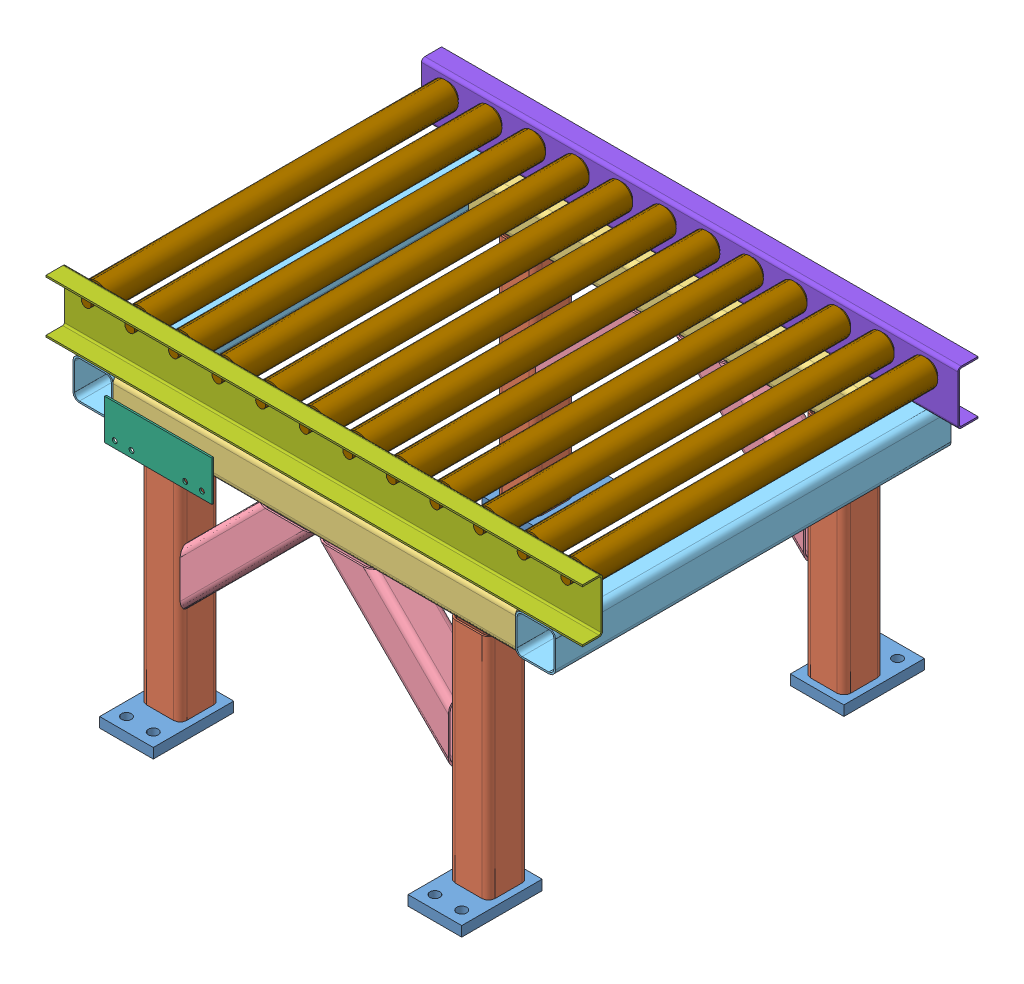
SolidWorks assembly conveyor.SLDASM, configuration Default (file format 11000). Lengths in mm.
Overall size (1016 628.65 876.3).
33 component instances, 9 part files, 3 mates.
Components (placement in the parent):
- conveyor_frame-1: conveyor_frame.SLDASM [Default] at origin size (914.4 527.05 876.3)
  - supp_base_pl-1: supp_base_pl.SLDPRT [Default] at origin size (101.6 19.05 152.4)
  - supp_ts3x3_vert-1: supp_ts3x3_vert.SLDPRT [Default] at (50.8 450.85 -101.6) x (1 0 0) z (0 -1 0) size (76.2 76.2 431.8)
  - supp_ts3x3_hor30-1: supp_ts3x3_hor30.SLDPRT [Default] at (723.9 488.95 -101.6) x (0 0 -1) z (-1 0 0) size (76.2 76.2 762)
  - supp_ts3x3_vert-2: supp_ts3x3_vert.SLDPRT [Default] at (635 19.05 -101.6) x (1 0 0) z (0 1 0) size (76.2 76.2 431.8)
  - supp_base_pl-2: supp_base_pl.SLDPRT [Default] at (584.2 0 0) size (101.6 19.05 152.4)
  - supp_ts3x3_ang45-1: supp_ts3x3_ang45.SLDPRT [Default] at (313.4064 480.9658 -101.6) x (0 0 1) z (-0.707107 -0.707107 0) size (76.2 76.2 355.6)
  - supp_ts3x3_ang45-2: supp_ts3x3_ang45.SLDPRT [Default] at (372.3936 477.7908 -101.6) x (0 0 -1) z (0.707107 -0.707107 0) size (76.2 76.2 355.6)
  - supp_ts3x3_hor295-1: supp_ts3x3_hor295.SLDPRT [Default] at (-76.2 488.95 -63.5) x (-1 0 0) z (0 0 -1) size (76.2 76.2 749.3)
  - supp_ts3x3_hor295-2: supp_ts3x3_hor295.SLDPRT [Default] at (762 488.95 -812.8) size (76.2 76.2 749.3)
  - supp_ts3x3_hor30-2: supp_ts3x3_hor30.SLDPRT [Default] at (723.9 488.95 -774.7) x (0 0 1) z (-1 0 0) size (76.2 76.2 762)
  - supp_ts3x3_vert-3: supp_ts3x3_vert.SLDPRT [Default] at (635 450.85 -774.7) x (1 0 0) z (0 -1 0) size (76.2 76.2 431.8)
  - supp_ts3x3_vert-4: supp_ts3x3_vert.SLDPRT [Default] at (50.8 19.05 -774.7) x (0 0 -1) z (0 1 0) size (76.2 76.2 431.8)
  - supp_ts3x3_ang45-3: supp_ts3x3_ang45.SLDPRT [Default] at (372.3936 477.7908 -774.7) x (0 0 -1) z (0.707107 -0.707107 0) size (76.2 76.2 355.6)
  - supp_ts3x3_ang45-4: supp_ts3x3_ang45.SLDPRT [Default] at (61.9592 226.3436 -774.7) x (0 0 -1) z (0.707107 0.707107 0) size (76.2 76.2 355.6)
  - supp_base_pl-3: supp_base_pl.SLDPRT [Default] at (685.8 0 -876.3) x (-1 0 0) z (0 0 -1) size (101.6 19.05 152.4)
  - supp_base_pl-4: supp_base_pl.SLDPRT [Default] at (101.6 0 -876.3) x (-1 0 0) z (0 0 -1) size (101.6 19.05 152.4)
  - Mtg_Pl-1: Mtg_Pl.sldprt [Default] at (152.4 488.95 -63.5) x (-1 0 0) z (0 0 1) size (203.2 76.2 3.17)
- roller_frame-1: roller_frame.SLDASM [simplified] at (-165.1 628.65 -101.6) size (1016 101.6 749.3)
  - conv_right_rail-1: conv_right_rail.SLDPRT [Default] at origin size (1016 101.6 38.1)
  - conv_left_rail-1: conv_left_rail.SLDPRT [Default] at (0 0 -673.1) size (1016 101.6 38.1)
  - RLLR-1: RLLR.SLDPRT [simplified] at (50.8 -31.75 -336.55) size (50.8 50.8 698.5)
  - RLLR-2: RLLR.SLDPRT [simplified] at (133.35 -31.75 -336.55) size (50.8 50.8 698.5)
  - RLLR-3: RLLR.SLDPRT [simplified] at (215.9 -31.75 -336.55) size (50.8 50.8 698.5)
  - RLLR-4: RLLR.SLDPRT [simplified] at (298.45 -31.75 -336.55) size (50.8 50.8 698.5)
  - RLLR-5: RLLR.SLDPRT [simplified] at (381 -31.75 -336.55) size (50.8 50.8 698.5)
  - RLLR-6: RLLR.SLDPRT [simplified] at (463.55 -31.75 -336.55) size (50.8 50.8 698.5)
  - RLLR-7: RLLR.SLDPRT [simplified] at (546.1 -31.75 -336.55) size (50.8 50.8 698.5)
  - RLLR-8: RLLR.SLDPRT [simplified] at (628.65 -31.75 -336.55) size (50.8 50.8 698.5)
  - RLLR-9: RLLR.SLDPRT [simplified] at (711.2 -31.75 -336.55) size (50.8 50.8 698.5)
  - RLLR-10: RLLR.SLDPRT [simplified] at (793.75 -31.75 -336.55) size (50.8 50.8 698.5)
  - RLLR-11: RLLR.SLDPRT [simplified] at (876.3 -31.75 -336.55) size (50.8 50.8 698.5)
  - RLLR-12: RLLR.SLDPRT [simplified] at (958.85 -31.75 -336.55) size (50.8 50.8 698.5)
Mates (geometry in assembly coordinates):
- Coincident1: coincident: plane of conveyor_frame-1/supp_ts3x3_hor30-1 through (-38.1 527.05 -127) normal (0 1 0); plane of roller_frame-1/conv_right_rail-1 through (850.9 527.05 -101.6) normal (0 -1 0)
- Distance1: distance = 50.8 mm: plane of conveyor_frame-1/supp_ts3x3_hor295-1 through (-114.3 463.55 -812.8) normal (-1 0 0); plane of roller_frame-1/conv_right_rail-1 through (-165.1 527.05 -63.5) normal (-1 0 0)
- Coincident2: coincident: plane of conveyor_frame-1/supp_ts3x3_hor30-1 through (-38.1 463.55 -63.5) normal (0 0 1); plane of roller_frame-1/conv_right_rail-1 through (850.9 625.475 -63.5) normal (0 0 1)
